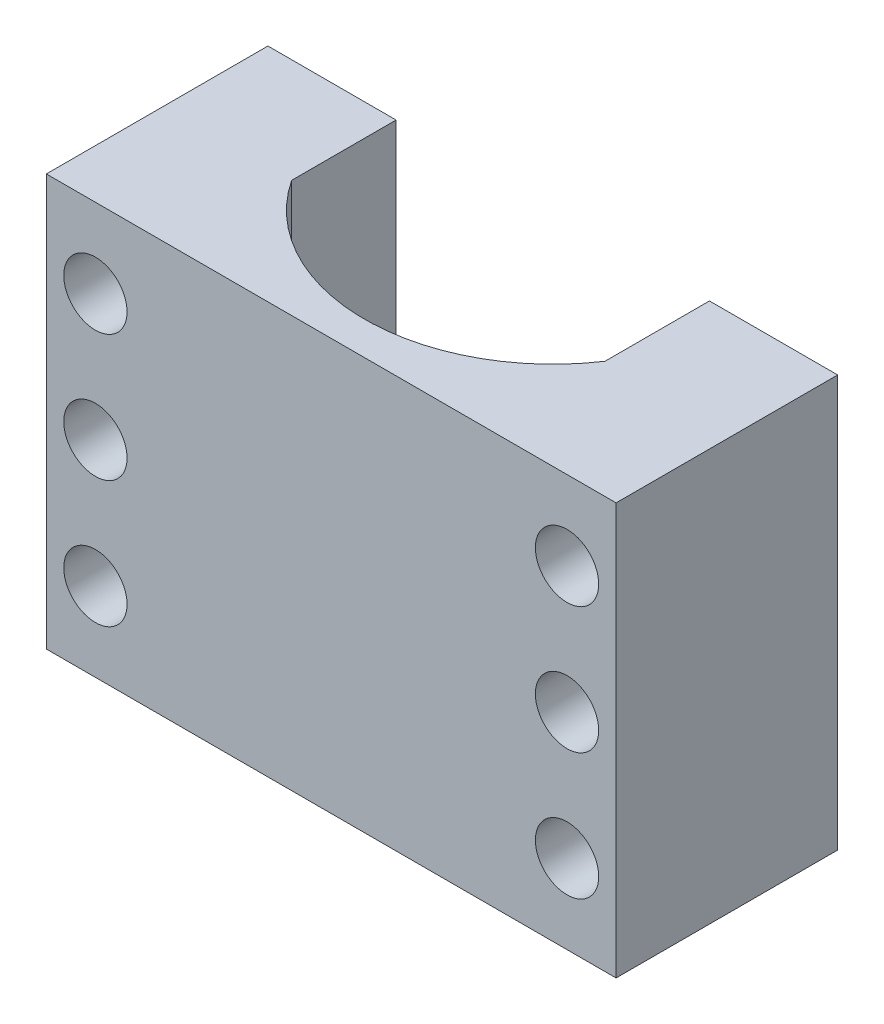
from build123d import *

# Parameters (mm, degrees)
SKETCH_1_W          = 3.05
SKETCH_1_H          = 13
SKETCH_1_R          = 1
SKETCH_1_W_2        = 11.9
EXTRUDE_1_DEPTH     = 14
SKETCH_2_R          = 1
CUT_EXTRUDE_1_DEPTH = 18.867568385
CUT_EXTRUDE_2_DEPTH = 22.118712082
SKETCH_5_W          = 18
SKETCH_5_H          = 13
CUT_EXTRUDE_3_DEPTH = 7


with BuildPart() as part:
    # Sketch 1 → Extrude 1 (new body)
    # profile 1 of 4: a face of its own
    with BuildSketch(Plane.XY):
        with Locations((-7.475, 0)):
            Rectangle(SKETCH_1_W, SKETCH_1_H)
        with Locations((-7.45, 4)):
            Circle(SKETCH_1_R, mode=Mode.SUBTRACT)
    # profile 2 of 4: a face of its own
    with BuildSketch(Plane.XY):
        Rectangle(SKETCH_1_W_2, SKETCH_1_H)
    # profile 3 of 4: a face of its own
    with BuildSketch(Plane.XY):
        with Locations((7.475, 0)):
            Rectangle(SKETCH_1_W, SKETCH_1_H)
    # profile 4 of 4: a face of its own
    with BuildSketch(Plane.XY):
        with Locations((-7.45, 4)):
            Circle(SKETCH_1_R)
    extrude(amount=EXTRUDE_1_DEPTH)

    # Sketch 2 → Cut-Extrude 1 (cut, through all)
    with BuildSketch(Plane.XY.offset(14)):
        with Locations((-7.45, 4)):
            Circle(SKETCH_2_R)
        with Locations(Location((-7.45, -4, 0), (0, 0, 180))):
            Circle(SKETCH_2_R)
        with Locations((7.45, -4)):
            Circle(SKETCH_2_R)
        with Locations(Location((7.45, 4, 0), (0, 0, 180))):
            Circle(SKETCH_2_R)
        with Locations((-7.45, 0)):
            Circle(SKETCH_2_R)
        with Locations(Location((7.45, 0, 0), (0, 0, 180))):
            Circle(SKETCH_2_R)
    extrude(amount=-CUT_EXTRUDE_1_DEPTH, mode=Mode.SUBTRACT)

    # Sketch 4 → Cut-Extrude 2 (cut, through all)
    with BuildSketch(Plane(origin=(0, 6.5, 0), x_dir=(1, 0, 0), z_dir=(0, 1, 0))):
        with BuildLine():
            Line((4.95, -10.301514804), (4.95, -3.698485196))
            ThreePointArc((4.95, -3.698485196), (0, -1.05), (-4.95, -3.698485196))
            Line((-4.95, -3.698485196), (-4.95, -10.301514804))
            ThreePointArc((-4.95, -10.301514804), (0, -12.95), (4.95, -10.301514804))
        make_face()
    extrude(amount=-CUT_EXTRUDE_2_DEPTH, mode=Mode.SUBTRACT)

    # Sketch 5 → Cut-Extrude 3 (cut)
    with BuildSketch(Plane(origin=(0, 0, 0), x_dir=(-1, 0, 0), z_dir=(0, 0, -1))):
        Rectangle(SKETCH_5_W, SKETCH_5_H)
    extrude(amount=-CUT_EXTRUDE_3_DEPTH, mode=Mode.SUBTRACT)


solid = part.part
